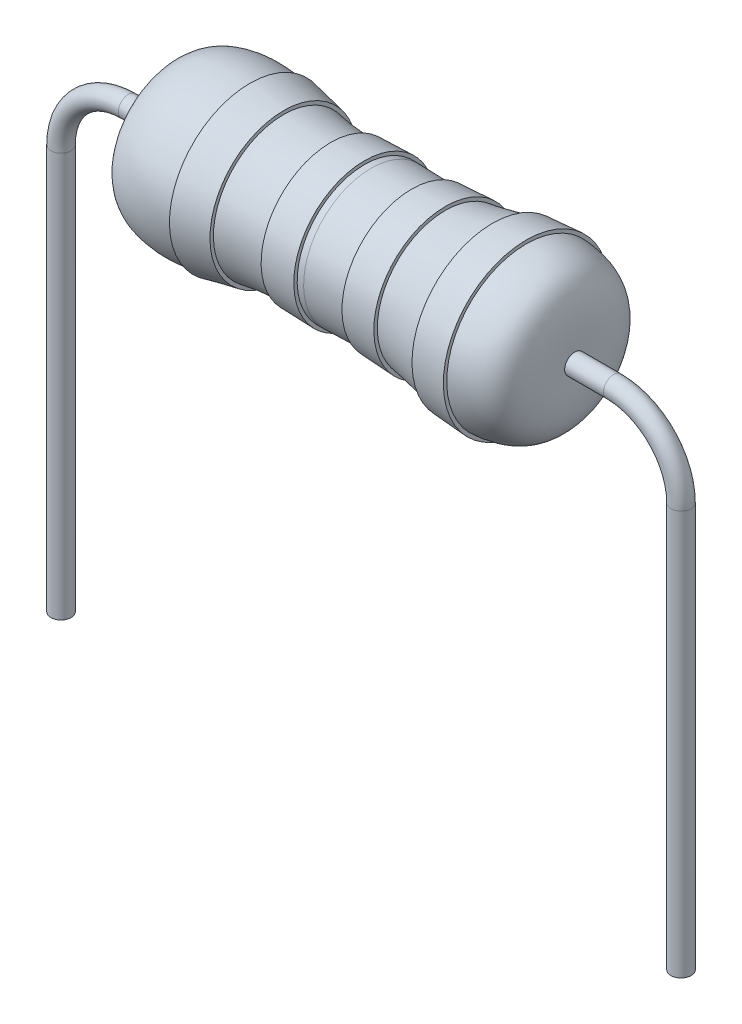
ISO-10303-21;
HEADER;
FILE_DESCRIPTION(('STEP AP214'),'2;1');
FILE_NAME('part.step','',(''),(''),'','','');
FILE_SCHEMA(('AUTOMOTIVE_DESIGN { 1 0 10303 214 1 1 1 1 }'));
ENDSEC;
DATA;
#1=APPLICATION_CONTEXT('core data for automotive mechanical design processes');
#2=APPLICATION_PROTOCOL_DEFINITION('international standard','automotive_design',2000,#1);
#3=PRODUCT_CONTEXT('',#1,'mechanical');
#4=PRODUCT('Part','Part','',(#3));
#5=PRODUCT_RELATED_PRODUCT_CATEGORY('part','',(#4));
#6=PRODUCT_DEFINITION_FORMATION('','',#4);
#7=PRODUCT_DEFINITION_CONTEXT('part definition',#1,'design');
#8=PRODUCT_DEFINITION('design','',#6,#7);
#9=PRODUCT_DEFINITION_SHAPE('','',#8);
#10=(LENGTH_UNIT() NAMED_UNIT(*) SI_UNIT(.MILLI.,.METRE.));
#11=(NAMED_UNIT(*) PLANE_ANGLE_UNIT() SI_UNIT($,.RADIAN.));
#12=(NAMED_UNIT(*) SI_UNIT($,.STERADIAN.) SOLID_ANGLE_UNIT());
#13=UNCERTAINTY_MEASURE_WITH_UNIT(LENGTH_MEASURE(1.E-05),#10,'distance_accuracy_value','');
#14=(GEOMETRIC_REPRESENTATION_CONTEXT(3) GLOBAL_UNCERTAINTY_ASSIGNED_CONTEXT((#13)) GLOBAL_UNIT_ASSIGNED_CONTEXT((#10,
#11,#12)) REPRESENTATION_CONTEXT('',''));
#15=CARTESIAN_POINT('',(0.,0.,0.));
#16=DIRECTION('',(0.,0.,1.));
#17=DIRECTION('',(1.,0.,0.));
#18=AXIS2_PLACEMENT_3D('',#15,#16,#17);
#19=CARTESIAN_POINT('',(-0.597354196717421,0.983703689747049,0.));
#20=CARTESIAN_POINT('',(-0.741393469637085,0.982379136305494,0.));
#21=CARTESIAN_POINT('',(-0.97114945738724,0.986743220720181,0.));
#22=CARTESIAN_POINT('',(-1.21027439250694,1.02468395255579,0.));
#23=CARTESIAN_POINT('',(-1.29735419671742,1.04115266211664,0.));
#24=B_SPLINE_CURVE_WITH_KNOTS('',3,(#19,#20,#21,#22,#23),.UNSPECIFIED.,.F.,.F.,(4,1,4),
(0.15485366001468,0.255892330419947,0.321578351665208),.UNSPECIFIED.);
#25=CARTESIAN_POINT('',(3.1,0.,0.));
#26=DIRECTION('',(1.,0.,0.));
#27=AXIS1_PLACEMENT('',#25,#26);
#28=SURFACE_OF_REVOLUTION('',#24,#27);
#29=CARTESIAN_POINT('',(-1.29735419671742,0.,0.));
#30=DIRECTION('',(1.,0.,0.));
#31=DIRECTION('',(0.,1.,0.));
#32=AXIS2_PLACEMENT_3D('',#29,#30,#31);
#33=CIRCLE('',#32,1.04115266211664);
#34=CARTESIAN_POINT('',(-1.29735419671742,1.04115266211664,0.));
#35=VERTEX_POINT('',#34);
#36=EDGE_CURVE('E10',#35,#35,#33,.T.);
#37=ORIENTED_EDGE('',*,*,#36,.T.);
#38=EDGE_LOOP('',(#37));
#39=FACE_BOUND('',#38,.T.);
#40=CARTESIAN_POINT('',(-0.597354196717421,0.,0.));
#41=DIRECTION('',(1.,0.,0.));
#42=DIRECTION('',(0.,1.,0.));
#43=AXIS2_PLACEMENT_3D('',#40,#41,#42);
#44=CIRCLE('',#43,0.98370368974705);
#45=CARTESIAN_POINT('',(-0.597354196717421,0.983703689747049,0.));
#46=VERTEX_POINT('',#45);
#47=EDGE_CURVE('E91',#46,#46,#44,.T.);
#48=ORIENTED_EDGE('',*,*,#47,.F.);
#49=EDGE_LOOP('',(#48));
#50=FACE_BOUND('',#49,.T.);
#51=ADVANCED_FACE('F29',(#39,#50),#28,.F.);
#52=CARTESIAN_POINT('',(-1.29735419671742,1.09232048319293,0.));
#53=DIRECTION('',(1.,0.,0.));
#54=DIRECTION('',(0.,1.,0.));
#55=AXIS2_PLACEMENT_3D('',#52,#53,#54);
#56=PLANE('',#55);
#57=CARTESIAN_POINT('',(-1.29735419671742,0.,0.));
#58=DIRECTION('',(1.,0.,0.));
#59=DIRECTION('',(0.,1.,0.));
#60=AXIS2_PLACEMENT_3D('',#57,#58,#59);
#61=CIRCLE('',#60,1.09232048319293);
#62=CARTESIAN_POINT('',(-1.29735419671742,1.09232048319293,0.));
#63=VERTEX_POINT('',#62);
#64=EDGE_CURVE('E36',#63,#63,#61,.T.);
#65=ORIENTED_EDGE('',*,*,#64,.T.);
#66=EDGE_LOOP('',(#65));
#67=FACE_BOUND('',#66,.T.);
#68=ORIENTED_EDGE('',*,*,#36,.F.);
#69=EDGE_LOOP('',(#68));
#70=FACE_BOUND('',#69,.T.);
#71=ADVANCED_FACE('F178',(#67,#70),#56,.T.);
#72=CARTESIAN_POINT('',(-1.29735419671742,0.,0.));
#73=DIRECTION('',(-1.,0.,0.));
#74=DIRECTION('',(0.,-1.,0.));
#75=AXIS2_PLACEMENT_3D('',#72,#73,#74);
#76=CONICAL_SURFACE('',#75,1.09232048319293,0.199712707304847);
#77=CARTESIAN_POINT('',(-1.79735419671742,0.,0.));
#78=DIRECTION('',(1.,0.,0.));
#79=DIRECTION('',(0.,1.,0.));
#80=AXIS2_PLACEMENT_3D('',#77,#78,#79);
#81=CIRCLE('',#80,1.1935259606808);
#82=CARTESIAN_POINT('',(-1.79735419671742,1.1935259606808,0.));
#83=VERTEX_POINT('',#82);
#84=EDGE_CURVE('E40',#83,#83,#81,.T.);
#85=ORIENTED_EDGE('',*,*,#84,.T.);
#86=EDGE_LOOP('',(#85));
#87=FACE_BOUND('',#86,.T.);
#88=ORIENTED_EDGE('',*,*,#64,.F.);
#89=EDGE_LOOP('',(#88));
#90=FACE_BOUND('',#89,.T.);
#91=ADVANCED_FACE('F175',(#87,#90),#76,.T.);
#92=CARTESIAN_POINT('',(-1.79735419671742,1.1935259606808,0.));
#93=DIRECTION('',(-1.,0.,0.));
#94=DIRECTION('',(0.,-1.,0.));
#95=AXIS2_PLACEMENT_3D('',#92,#93,#94);
#96=PLANE('',#95);
#97=CARTESIAN_POINT('',(-1.79735419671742,0.,0.));
#98=DIRECTION('',(1.,0.,0.));
#99=DIRECTION('',(0.,1.,0.));
#100=AXIS2_PLACEMENT_3D('',#97,#98,#99);
#101=CIRCLE('',#100,1.14275704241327);
#102=CARTESIAN_POINT('',(-1.79735419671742,1.14275704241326,0.));
#103=VERTEX_POINT('',#102);
#104=EDGE_CURVE('E44',#103,#103,#101,.T.);
#105=ORIENTED_EDGE('',*,*,#104,.T.);
#106=EDGE_LOOP('',(#105));
#107=FACE_BOUND('',#106,.T.);
#108=ORIENTED_EDGE('',*,*,#84,.F.);
#109=EDGE_LOOP('',(#108));
#110=FACE_BOUND('',#109,.T.);
#111=ADVANCED_FACE('F171',(#107,#110),#96,.T.);
#112=CARTESIAN_POINT('',(-1.79735419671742,1.14275704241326,0.));
#113=CARTESIAN_POINT('',(-1.96068782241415,1.17145675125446,0.));
#114=CARTESIAN_POINT('',(-2.31177453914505,1.20993253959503,0.));
#115=CARTESIAN_POINT('',(-3.04069848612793,1.04626137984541,0.));
#116=CARTESIAN_POINT('',(-3.0390580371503,0.470476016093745,0.));
#117=CARTESIAN_POINT('',(-3.02359149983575,0.15,0.));
#118=B_SPLINE_CURVE_WITH_KNOTS('',3,(#112,#113,#114,#115,#116,#117),.UNSPECIFIED.,.F.,.F.,(4,1,
1,4),(0.449746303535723,0.575550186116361,0.717128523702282,0.932875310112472),.UNSPECIFIED.);
#119=CARTESIAN_POINT('',(3.1,0.,0.));
#120=DIRECTION('',(1.,0.,0.));
#121=AXIS1_PLACEMENT('',#119,#120);
#122=SURFACE_OF_REVOLUTION('',#118,#121);
#123=CARTESIAN_POINT('',(-3.02359149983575,0.,0.));
#124=DIRECTION('',(1.,0.,0.));
#125=DIRECTION('',(0.,1.,0.));
#126=AXIS2_PLACEMENT_3D('',#123,#124,#125);
#127=CIRCLE('',#126,0.150000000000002);
#128=CARTESIAN_POINT('',(-3.02359149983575,0.15,0.));
#129=VERTEX_POINT('',#128);
#130=EDGE_CURVE('E49',#129,#129,#127,.T.);
#131=ORIENTED_EDGE('',*,*,#130,.T.);
#132=EDGE_LOOP('',(#131));
#133=FACE_BOUND('',#132,.T.);
#134=ORIENTED_EDGE('',*,*,#104,.F.);
#135=EDGE_LOOP('',(#134));
#136=FACE_BOUND('',#135,.T.);
#137=ADVANCED_FACE('F167',(#133,#136),#122,.F.);
#138=CARTESIAN_POINT('',(3.1,0.,0.));
#139=DIRECTION('',(1.,0.,0.));
#140=DIRECTION('',(0.,1.,0.));
#141=AXIS2_PLACEMENT_3D('',#138,#139,#140);
#142=CYLINDRICAL_SURFACE('',#141,0.150000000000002);
#143=ORIENTED_EDGE('',*,*,#130,.F.);
#144=EDGE_LOOP('',(#143));
#145=FACE_BOUND('',#144,.T.);
#146=CARTESIAN_POINT('',(-3.6,0.,0.));
#147=DIRECTION('',(1.,0.,0.));
#148=DIRECTION('',(0.,0.,-1.));
#149=AXIS2_PLACEMENT_3D('',#146,#147,#148);
#150=CIRCLE('',#149,0.15);
#151=CARTESIAN_POINT('',(-3.6,0.15,0.));
#152=VERTEX_POINT('',#151);
#153=EDGE_CURVE('E441',#152,#152,#150,.T.);
#154=ORIENTED_EDGE('',*,*,#153,.T.);
#155=EDGE_LOOP('',(#154));
#156=FACE_BOUND('',#155,.T.);
#157=ADVANCED_FACE('F163',(#145,#156),#142,.T.);
#158=CARTESIAN_POINT('',(3.1,0.,0.));
#159=DIRECTION('',(1.,0.,0.));
#160=DIRECTION('',(0.,1.,0.));
#161=AXIS2_PLACEMENT_3D('',#158,#159,#160);
#162=CYLINDRICAL_SURFACE('',#161,0.15);
#163=CARTESIAN_POINT('',(3.02359150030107,0.,0.));
#164=DIRECTION('',(1.,0.,0.));
#165=DIRECTION('',(0.,1.,0.));
#166=AXIS2_PLACEMENT_3D('',#163,#164,#165);
#167=CIRCLE('',#166,0.15);
#168=CARTESIAN_POINT('',(3.02359150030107,0.15,0.));
#169=VERTEX_POINT('',#168);
#170=EDGE_CURVE('E52',#169,#169,#167,.T.);
#171=ORIENTED_EDGE('',*,*,#170,.T.);
#172=EDGE_LOOP('',(#171));
#173=FACE_BOUND('',#172,.T.);
#174=CARTESIAN_POINT('',(3.6,0.,0.));
#175=DIRECTION('',(1.,0.,0.));
#176=DIRECTION('',(0.,0.,-1.));
#177=AXIS2_PLACEMENT_3D('',#174,#175,#176);
#178=CIRCLE('',#177,0.15);
#179=CARTESIAN_POINT('',(3.6,0.15,0.));
#180=VERTEX_POINT('',#179);
#181=EDGE_CURVE('E235',#180,#180,#178,.T.);
#182=ORIENTED_EDGE('',*,*,#181,.F.);
#183=EDGE_LOOP('',(#182));
#184=FACE_BOUND('',#183,.T.);
#185=ADVANCED_FACE('F159',(#173,#184),#162,.T.);
#186=CARTESIAN_POINT('',(3.02359150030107,0.15,0.));
#187=CARTESIAN_POINT('',(3.03906853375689,0.470693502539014,0.));
#188=CARTESIAN_POINT('',(3.04040701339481,1.04615882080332,0.));
#189=CARTESIAN_POINT('',(2.50195996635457,1.16735450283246,0.));
#190=CARTESIAN_POINT('',(2.30264580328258,1.17909283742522,0.));
#191=B_SPLINE_CURVE_WITH_KNOTS('',3,(#186,#187,#188,#189,#190),.UNSPECIFIED.,.F.,.F.,(4,1,4),
(0.575307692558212,0.791200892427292,0.932875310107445),.UNSPECIFIED.);
#192=CARTESIAN_POINT('',(3.1,0.,0.));
#193=DIRECTION('',(1.,0.,0.));
#194=AXIS1_PLACEMENT('',#192,#193);
#195=SURFACE_OF_REVOLUTION('',#191,#194);
#196=CARTESIAN_POINT('',(2.30264580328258,0.,0.));
#197=DIRECTION('',(1.,0.,0.));
#198=DIRECTION('',(0.,1.,0.));
#199=AXIS2_PLACEMENT_3D('',#196,#197,#198);
#200=CIRCLE('',#199,1.17909283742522);
#201=CARTESIAN_POINT('',(2.30264580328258,1.17909283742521,0.));
#202=VERTEX_POINT('',#201);
#203=EDGE_CURVE('E55',#202,#202,#200,.T.);
#204=ORIENTED_EDGE('',*,*,#203,.T.);
#205=EDGE_LOOP('',(#204));
#206=FACE_BOUND('',#205,.T.);
#207=ORIENTED_EDGE('',*,*,#170,.F.);
#208=EDGE_LOOP('',(#207));
#209=FACE_BOUND('',#208,.T.);
#210=ADVANCED_FACE('F154',(#206,#209),#195,.F.);
#211=CARTESIAN_POINT('',(2.30264580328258,1.17909283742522,0.));
#212=DIRECTION('',(1.,0.,0.));
#213=DIRECTION('',(0.,1.,0.));
#214=AXIS2_PLACEMENT_3D('',#211,#212,#213);
#215=PLANE('',#214);
#216=CARTESIAN_POINT('',(2.30264580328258,0.,0.));
#217=DIRECTION('',(1.,0.,0.));
#218=DIRECTION('',(0.,1.,0.));
#219=AXIS2_PLACEMENT_3D('',#216,#217,#218);
#220=CIRCLE('',#219,1.22914772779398);
#221=CARTESIAN_POINT('',(2.30264580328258,1.22914772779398,0.));
#222=VERTEX_POINT('',#221);
#223=EDGE_CURVE('E58',#222,#222,#220,.T.);
#224=ORIENTED_EDGE('',*,*,#223,.T.);
#225=EDGE_LOOP('',(#224));
#226=FACE_BOUND('',#225,.T.);
#227=ORIENTED_EDGE('',*,*,#203,.F.);
#228=EDGE_LOOP('',(#227));
#229=FACE_BOUND('',#228,.T.);
#230=ADVANCED_FACE('F158',(#226,#229),#215,.T.);
#231=CARTESIAN_POINT('',(2.30264580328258,0.,0.));
#232=DIRECTION('',(1.,0.,0.));
#233=DIRECTION('',(0.,1.,0.));
#234=AXIS2_PLACEMENT_3D('',#231,#232,#233);
#235=CONICAL_SURFACE('',#234,1.22914772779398,0.0693079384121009);
#236=CARTESIAN_POINT('',(1.80264580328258,0.,0.));
#237=DIRECTION('',(1.,0.,0.));
#238=DIRECTION('',(0.,1.,0.));
#239=AXIS2_PLACEMENT_3D('',#236,#237,#238);
#240=CIRCLE('',#239,1.19443816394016);
#241=CARTESIAN_POINT('',(1.80264580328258,1.19443816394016,0.));
#242=VERTEX_POINT('',#241);
#243=EDGE_CURVE('E61',#242,#242,#240,.T.);
#244=ORIENTED_EDGE('',*,*,#243,.T.);
#245=EDGE_LOOP('',(#244));
#246=FACE_BOUND('',#245,.T.);
#247=ORIENTED_EDGE('',*,*,#223,.F.);
#248=EDGE_LOOP('',(#247));
#249=FACE_BOUND('',#248,.T.);
#250=ADVANCED_FACE('F220',(#246,#249),#235,.T.);
#251=CARTESIAN_POINT('',(1.80264580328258,1.19443816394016,0.));
#252=DIRECTION('',(-1.,0.,0.));
#253=DIRECTION('',(0.,-1.,0.));
#254=AXIS2_PLACEMENT_3D('',#251,#252,#253);
#255=PLANE('',#254);
#256=CARTESIAN_POINT('',(1.80264580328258,0.,0.));
#257=DIRECTION('',(1.,0.,0.));
#258=DIRECTION('',(0.,1.,0.));
#259=AXIS2_PLACEMENT_3D('',#256,#257,#258);
#260=CIRCLE('',#259,1.14368296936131);
#261=CARTESIAN_POINT('',(1.80264580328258,1.14368296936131,0.));
#262=VERTEX_POINT('',#261);
#263=EDGE_CURVE('E64',#262,#262,#260,.T.);
#264=ORIENTED_EDGE('',*,*,#263,.T.);
#265=EDGE_LOOP('',(#264));
#266=FACE_BOUND('',#265,.T.);
#267=ORIENTED_EDGE('',*,*,#243,.F.);
#268=EDGE_LOOP('',(#267));
#269=FACE_BOUND('',#268,.T.);
#270=ADVANCED_FACE('F133',(#266,#269),#255,.T.);
#271=CARTESIAN_POINT('',(1.80264580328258,1.14368296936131,0.));
#272=CARTESIAN_POINT('',(1.57185221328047,1.10347001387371,0.));
#273=CARTESIAN_POINT('',(1.34646533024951,1.0417378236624,0.));
#274=CARTESIAN_POINT('',(1.10264580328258,1.0093635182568,0.));
#275=B_SPLINE_CURVE_WITH_KNOTS('',3,(#271,#272,#273,#274),.UNSPECIFIED.,.F.,.F.,(4,4),
(0.273403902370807,0.451104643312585),.UNSPECIFIED.);
#276=CARTESIAN_POINT('',(3.1,0.,0.));
#277=DIRECTION('',(1.,0.,0.));
#278=AXIS1_PLACEMENT('',#276,#277);
#279=SURFACE_OF_REVOLUTION('',#275,#278);
#280=CARTESIAN_POINT('',(1.10264580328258,0.,0.));
#281=DIRECTION('',(1.,0.,0.));
#282=DIRECTION('',(0.,1.,0.));
#283=AXIS2_PLACEMENT_3D('',#280,#281,#282);
#284=CIRCLE('',#283,1.0093635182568);
#285=CARTESIAN_POINT('',(1.10264580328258,1.0093635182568,0.));
#286=VERTEX_POINT('',#285);
#287=EDGE_CURVE('E67',#286,#286,#284,.T.);
#288=ORIENTED_EDGE('',*,*,#287,.T.);
#289=EDGE_LOOP('',(#288));
#290=FACE_BOUND('',#289,.T.);
#291=ORIENTED_EDGE('',*,*,#263,.F.);
#292=EDGE_LOOP('',(#291));
#293=FACE_BOUND('',#292,.T.);
#294=ADVANCED_FACE('F129',(#290,#293),#279,.F.);
#295=CARTESIAN_POINT('',(1.10264580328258,1.0605778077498,0.));
#296=DIRECTION('',(1.,0.,0.));
#297=DIRECTION('',(0.,1.,0.));
#298=AXIS2_PLACEMENT_3D('',#295,#296,#297);
#299=PLANE('',#298);
#300=CARTESIAN_POINT('',(1.10264580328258,0.,0.));
#301=DIRECTION('',(1.,0.,0.));
#302=DIRECTION('',(0.,1.,0.));
#303=AXIS2_PLACEMENT_3D('',#300,#301,#302);
#304=CIRCLE('',#303,1.0605778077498);
#305=CARTESIAN_POINT('',(1.10264580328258,1.0605778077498,0.));
#306=VERTEX_POINT('',#305);
#307=EDGE_CURVE('E70',#306,#306,#304,.T.);
#308=ORIENTED_EDGE('',*,*,#307,.T.);
#309=EDGE_LOOP('',(#308));
#310=FACE_BOUND('',#309,.T.);
#311=ORIENTED_EDGE('',*,*,#287,.F.);
#312=EDGE_LOOP('',(#311));
#313=FACE_BOUND('',#312,.T.);
#314=ADVANCED_FACE('F125',(#310,#313),#299,.T.);
#315=CARTESIAN_POINT('',(1.10264580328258,0.,0.));
#316=DIRECTION('',(1.,0.,0.));
#317=DIRECTION('',(0.,1.,0.));
#318=AXIS2_PLACEMENT_3D('',#315,#316,#317);
#319=CONICAL_SURFACE('',#318,1.0605778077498,0.054415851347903);
#320=CARTESIAN_POINT('',(0.60264580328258,0.,0.));
#321=DIRECTION('',(1.,0.,0.));
#322=DIRECTION('',(0.,1.,0.));
#323=AXIS2_PLACEMENT_3D('',#320,#321,#322);
#324=CIRCLE('',#323,1.03334299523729);
#325=CARTESIAN_POINT('',(0.602645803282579,1.03334299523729,0.));
#326=VERTEX_POINT('',#325);
#327=EDGE_CURVE('E73',#326,#326,#324,.T.);
#328=ORIENTED_EDGE('',*,*,#327,.T.);
#329=EDGE_LOOP('',(#328));
#330=FACE_BOUND('',#329,.T.);
#331=ORIENTED_EDGE('',*,*,#307,.F.);
#332=EDGE_LOOP('',(#331));
#333=FACE_BOUND('',#332,.T.);
#334=ADVANCED_FACE('F121',(#330,#333),#319,.T.);
#335=CARTESIAN_POINT('',(0.602645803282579,1.03334299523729,0.));
#336=DIRECTION('',(-1.,0.,0.));
#337=DIRECTION('',(0.,-1.,0.));
#338=AXIS2_PLACEMENT_3D('',#335,#336,#337);
#339=PLANE('',#338);
#340=CARTESIAN_POINT('',(0.60264580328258,0.,0.));
#341=DIRECTION('',(1.,0.,0.));
#342=DIRECTION('',(0.,1.,0.));
#343=AXIS2_PLACEMENT_3D('',#340,#341,#342);
#344=CIRCLE('',#343,0.983657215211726);
#345=CARTESIAN_POINT('',(0.602645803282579,0.983657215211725,0.));
#346=VERTEX_POINT('',#345);
#347=EDGE_CURVE('E76',#346,#346,#344,.T.);
#348=ORIENTED_EDGE('',*,*,#347,.T.);
#349=EDGE_LOOP('',(#348));
#350=FACE_BOUND('',#349,.T.);
#351=ORIENTED_EDGE('',*,*,#327,.F.);
#352=EDGE_LOOP('',(#351));
#353=FACE_BOUND('',#352,.T.);
#354=ADVANCED_FACE('F117',(#350,#353),#339,.T.);
#355=CARTESIAN_POINT('',(0.602645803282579,0.983657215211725,0.));
#356=CARTESIAN_POINT('',(0.379986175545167,0.985520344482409,0.));
#357=CARTESIAN_POINT('',(0.165951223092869,0.999033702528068,0.));
#358=CARTESIAN_POINT('',(0.,1.,0.));
#359=B_SPLINE_CURVE_WITH_KNOTS('',3,(#355,#356,#357,#358),.UNSPECIFIED.,.F.,.F.,(4,4),(0.,
0.156090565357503),.UNSPECIFIED.);
#360=CARTESIAN_POINT('',(3.1,0.,0.));
#361=DIRECTION('',(1.,0.,0.));
#362=AXIS1_PLACEMENT('',#360,#361);
#363=SURFACE_OF_REVOLUTION('',#359,#362);
#364=CARTESIAN_POINT('',(0.,0.,0.));
#365=DIRECTION('',(1.,0.,0.));
#366=DIRECTION('',(0.,1.,0.));
#367=AXIS2_PLACEMENT_3D('',#364,#365,#366);
#368=CIRCLE('',#367,1.);
#369=CARTESIAN_POINT('',(0.,1.,0.));
#370=VERTEX_POINT('',#369);
#371=EDGE_CURVE('E79',#370,#370,#368,.T.);
#372=ORIENTED_EDGE('',*,*,#371,.T.);
#373=EDGE_LOOP('',(#372));
#374=FACE_BOUND('',#373,.T.);
#375=ORIENTED_EDGE('',*,*,#347,.F.);
#376=EDGE_LOOP('',(#375));
#377=FACE_BOUND('',#376,.T.);
#378=ADVANCED_FACE('F112',(#374,#377),#363,.F.);
#379=CARTESIAN_POINT('',(0.,1.,0.));
#380=CARTESIAN_POINT('',(-0.0308720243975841,0.99982023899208,0.));
#381=CARTESIAN_POINT('',(-0.0634081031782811,0.99920625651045,0.));
#382=CARTESIAN_POINT('',(-0.0973541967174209,0.998313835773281,0.));
#383=B_SPLINE_CURVE_WITH_KNOTS('',3,(#379,#380,#381,#382),.UNSPECIFIED.,.F.,.F.,(4,4),(0.,
0.0290376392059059),.UNSPECIFIED.);
#384=CARTESIAN_POINT('',(3.1,0.,0.));
#385=DIRECTION('',(1.,0.,0.));
#386=AXIS1_PLACEMENT('',#384,#385);
#387=SURFACE_OF_REVOLUTION('',#383,#386);
#388=CARTESIAN_POINT('',(-0.0973541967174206,0.,0.));
#389=DIRECTION('',(1.,0.,0.));
#390=DIRECTION('',(0.,1.,0.));
#391=AXIS2_PLACEMENT_3D('',#388,#389,#390);
#392=CIRCLE('',#391,0.998313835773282);
#393=CARTESIAN_POINT('',(-0.097354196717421,0.998313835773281,0.));
#394=VERTEX_POINT('',#393);
#395=EDGE_CURVE('E82',#394,#394,#392,.T.);
#396=ORIENTED_EDGE('',*,*,#395,.T.);
#397=EDGE_LOOP('',(#396));
#398=FACE_BOUND('',#397,.T.);
#399=ORIENTED_EDGE('',*,*,#371,.F.);
#400=EDGE_LOOP('',(#399));
#401=FACE_BOUND('',#400,.T.);
#402=ADVANCED_FACE('F107',(#398,#401),#387,.F.);
#403=CARTESIAN_POINT('',(-0.0973541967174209,1.04852779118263,0.));
#404=DIRECTION('',(1.,0.,0.));
#405=DIRECTION('',(0.,1.,0.));
#406=AXIS2_PLACEMENT_3D('',#403,#404,#405);
#407=PLANE('',#406);
#408=CARTESIAN_POINT('',(-0.0973541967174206,0.,0.));
#409=DIRECTION('',(1.,0.,0.));
#410=DIRECTION('',(0.,1.,0.));
#411=AXIS2_PLACEMENT_3D('',#408,#409,#410);
#412=CIRCLE('',#411,1.04852779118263);
#413=CARTESIAN_POINT('',(-0.097354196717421,1.04852779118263,0.));
#414=VERTEX_POINT('',#413);
#415=EDGE_CURVE('E85',#414,#414,#412,.T.);
#416=ORIENTED_EDGE('',*,*,#415,.T.);
#417=EDGE_LOOP('',(#416));
#418=FACE_BOUND('',#417,.T.);
#419=ORIENTED_EDGE('',*,*,#395,.F.);
#420=EDGE_LOOP('',(#419));
#421=FACE_BOUND('',#420,.T.);
#422=ADVANCED_FACE('F111',(#418,#421),#407,.T.);
#423=CARTESIAN_POINT('',(-0.0973541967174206,0.,0.));
#424=DIRECTION('',(1.,0.,0.));
#425=DIRECTION('',(0.,1.,0.));
#426=AXIS2_PLACEMENT_3D('',#423,#424,#425);
#427=CONICAL_SURFACE('',#426,1.04852779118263,0.0302525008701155);
#428=CARTESIAN_POINT('',(-0.597354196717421,0.,0.));
#429=DIRECTION('',(1.,0.,0.));
#430=DIRECTION('',(0.,1.,0.));
#431=AXIS2_PLACEMENT_3D('',#428,#429,#430);
#432=CIRCLE('',#431,1.03339692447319);
#433=CARTESIAN_POINT('',(-0.597354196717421,1.03339692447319,0.));
#434=VERTEX_POINT('',#433);
#435=EDGE_CURVE('E88',#434,#434,#432,.T.);
#436=ORIENTED_EDGE('',*,*,#435,.T.);
#437=EDGE_LOOP('',(#436));
#438=FACE_BOUND('',#437,.T.);
#439=ORIENTED_EDGE('',*,*,#415,.F.);
#440=EDGE_LOOP('',(#439));
#441=FACE_BOUND('',#440,.T.);
#442=ADVANCED_FACE('F194',(#438,#441),#427,.T.);
#443=CARTESIAN_POINT('',(-0.597354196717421,1.03339692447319,0.));
#444=DIRECTION('',(-1.,0.,0.));
#445=DIRECTION('',(0.,-1.,0.));
#446=AXIS2_PLACEMENT_3D('',#443,#444,#445);
#447=PLANE('',#446);
#448=ORIENTED_EDGE('',*,*,#47,.T.);
#449=EDGE_LOOP('',(#448));
#450=FACE_BOUND('',#449,.T.);
#451=ORIENTED_EDGE('',*,*,#435,.F.);
#452=EDGE_LOOP('',(#451));
#453=FACE_BOUND('',#452,.T.);
#454=ADVANCED_FACE('F190',(#450,#453),#447,.T.);
#455=CARTESIAN_POINT('',(4.6,-1.,0.));
#456=DIRECTION('',(0.,-1.,0.));
#457=DIRECTION('',(1.,0.,0.));
#458=AXIS2_PLACEMENT_3D('',#455,#456,#457);
#459=CYLINDRICAL_SURFACE('',#458,0.15);
#460=CARTESIAN_POINT('',(4.6,-1.,0.));
#461=DIRECTION('',(0.,-1.,0.));
#462=DIRECTION('',(0.,0.,-1.));
#463=AXIS2_PLACEMENT_3D('',#460,#461,#462);
#464=CIRCLE('',#463,0.15);
#465=CARTESIAN_POINT('',(4.75,-1.,0.));
#466=VERTEX_POINT('',#465);
#467=EDGE_CURVE('E237',#466,#466,#464,.T.);
#468=ORIENTED_EDGE('',*,*,#467,.T.);
#469=EDGE_LOOP('',(#468));
#470=FACE_BOUND('',#469,.T.);
#471=CARTESIAN_POINT('',(4.6,-7.,0.));
#472=DIRECTION('',(0.,-1.,0.));
#473=DIRECTION('',(0.,0.,-1.));
#474=AXIS2_PLACEMENT_3D('',#471,#472,#473);
#475=CIRCLE('',#474,0.15);
#476=CARTESIAN_POINT('',(4.6,-7.,-0.15));
#477=VERTEX_POINT('',#476);
#478=EDGE_CURVE('E94',#477,#477,#475,.T.);
#479=ORIENTED_EDGE('',*,*,#478,.F.);
#480=EDGE_LOOP('',(#479));
#481=FACE_BOUND('',#480,.T.);
#482=ADVANCED_FACE('F193',(#470,#481),#459,.T.);
#483=CARTESIAN_POINT('',(3.6,-1.,0.));
#484=DIRECTION('',(0.,0.,-1.));
#485=DIRECTION('',(-1.,0.,0.));
#486=AXIS2_PLACEMENT_3D('',#483,#484,#485);
#487=TOROIDAL_SURFACE('',#486,1.,0.15);
#488=CARTESIAN_POINT('',(3.6,-1.,0.));
#489=DIRECTION('',(0.,0.,-1.));
#490=DIRECTION('',(-1.,0.,0.));
#491=AXIS2_PLACEMENT_3D('',#488,#489,#490);
#492=CIRCLE('',#491,1.15);
#493=EDGE_CURVE('',#180,#466,#492,.T.);
#494=ORIENTED_EDGE('',*,*,#181,.T.);
#495=ORIENTED_EDGE('',*,*,#467,.F.);
#496=ORIENTED_EDGE('',*,*,#493,.T.);
#497=ORIENTED_EDGE('',*,*,#493,.F.);
#498=EDGE_LOOP('',(#494,#496,#495,#497));
#499=FACE_BOUND('',#498,.T.);
#500=ADVANCED_FACE('F259',(#499),#487,.T.);
#501=CARTESIAN_POINT('',(4.6,-7.,0.));
#502=DIRECTION('',(0.,-1.,0.));
#503=DIRECTION('',(0.,0.,-1.));
#504=AXIS2_PLACEMENT_3D('',#501,#502,#503);
#505=PLANE('',#504);
#506=ORIENTED_EDGE('',*,*,#478,.T.);
#507=EDGE_LOOP('',(#506));
#508=FACE_BOUND('',#507,.T.);
#509=ADVANCED_FACE('F256',(#508),#505,.T.);
#510=CARTESIAN_POINT('',(-4.6,-1.,0.));
#511=DIRECTION('',(0.,-1.,0.));
#512=DIRECTION('',(1.,0.,0.));
#513=AXIS2_PLACEMENT_3D('',#510,#511,#512);
#514=CYLINDRICAL_SURFACE('',#513,0.15);
#515=CARTESIAN_POINT('',(-4.6,-1.,0.));
#516=DIRECTION('',(0.,1.,0.));
#517=DIRECTION('',(0.,0.,-1.));
#518=AXIS2_PLACEMENT_3D('',#515,#516,#517);
#519=CIRCLE('',#518,0.15);
#520=CARTESIAN_POINT('',(-4.75,-1.,0.));
#521=VERTEX_POINT('',#520);
#522=EDGE_CURVE('E243',#521,#521,#519,.T.);
#523=ORIENTED_EDGE('',*,*,#522,.F.);
#524=EDGE_LOOP('',(#523));
#525=FACE_BOUND('',#524,.T.);
#526=CARTESIAN_POINT('',(-4.6,-7.,0.));
#527=DIRECTION('',(0.,1.,0.));
#528=DIRECTION('',(0.,0.,-1.));
#529=AXIS2_PLACEMENT_3D('',#526,#527,#528);
#530=CIRCLE('',#529,0.15);
#531=CARTESIAN_POINT('',(-4.6,-7.,-0.15));
#532=VERTEX_POINT('',#531);
#533=EDGE_CURVE('E238',#532,#532,#530,.T.);
#534=ORIENTED_EDGE('',*,*,#533,.T.);
#535=EDGE_LOOP('',(#534));
#536=FACE_BOUND('',#535,.T.);
#537=ADVANCED_FACE('F269',(#525,#536),#514,.T.);
#538=CARTESIAN_POINT('',(-3.6,-1.,0.));
#539=DIRECTION('',(0.,0.,1.));
#540=DIRECTION('',(1.,0.,0.));
#541=AXIS2_PLACEMENT_3D('',#538,#539,#540);
#542=TOROIDAL_SURFACE('',#541,1.,0.15);
#543=CARTESIAN_POINT('',(-3.6,-1.,0.));
#544=DIRECTION('',(0.,0.,1.));
#545=DIRECTION('',(1.,0.,0.));
#546=AXIS2_PLACEMENT_3D('',#543,#544,#545);
#547=CIRCLE('',#546,1.15);
#548=EDGE_CURVE('',#152,#521,#547,.T.);
#549=ORIENTED_EDGE('',*,*,#153,.F.);
#550=ORIENTED_EDGE('',*,*,#522,.T.);
#551=ORIENTED_EDGE('',*,*,#548,.T.);
#552=ORIENTED_EDGE('',*,*,#548,.F.);
#553=EDGE_LOOP('',(#549,#551,#550,#552));
#554=FACE_BOUND('',#553,.T.);
#555=ADVANCED_FACE('F272',(#554),#542,.T.);
#556=CARTESIAN_POINT('',(-4.6,-7.,0.));
#557=DIRECTION('',(0.,-1.,0.));
#558=DIRECTION('',(0.,0.,-1.));
#559=AXIS2_PLACEMENT_3D('',#556,#557,#558);
#560=PLANE('',#559);
#561=ORIENTED_EDGE('',*,*,#533,.F.);
#562=EDGE_LOOP('',(#561));
#563=FACE_BOUND('',#562,.T.);
#564=ADVANCED_FACE('F276',(#563),#560,.T.);
#565=CLOSED_SHELL('',(#51,#71,#91,#111,#137,#157,#185,#210,#230,#250,#270,#294,#314,#334,#354,
#378,#402,#422,#442,#454,#482,#500,#509,#537,#555,#564));
#566=MANIFOLD_SOLID_BREP('B2',#565);
#567=ADVANCED_BREP_SHAPE_REPRESENTATION('',(#18,#566),#14);
#568=SHAPE_DEFINITION_REPRESENTATION(#9,#567);
ENDSEC;
END-ISO-10303-21;
